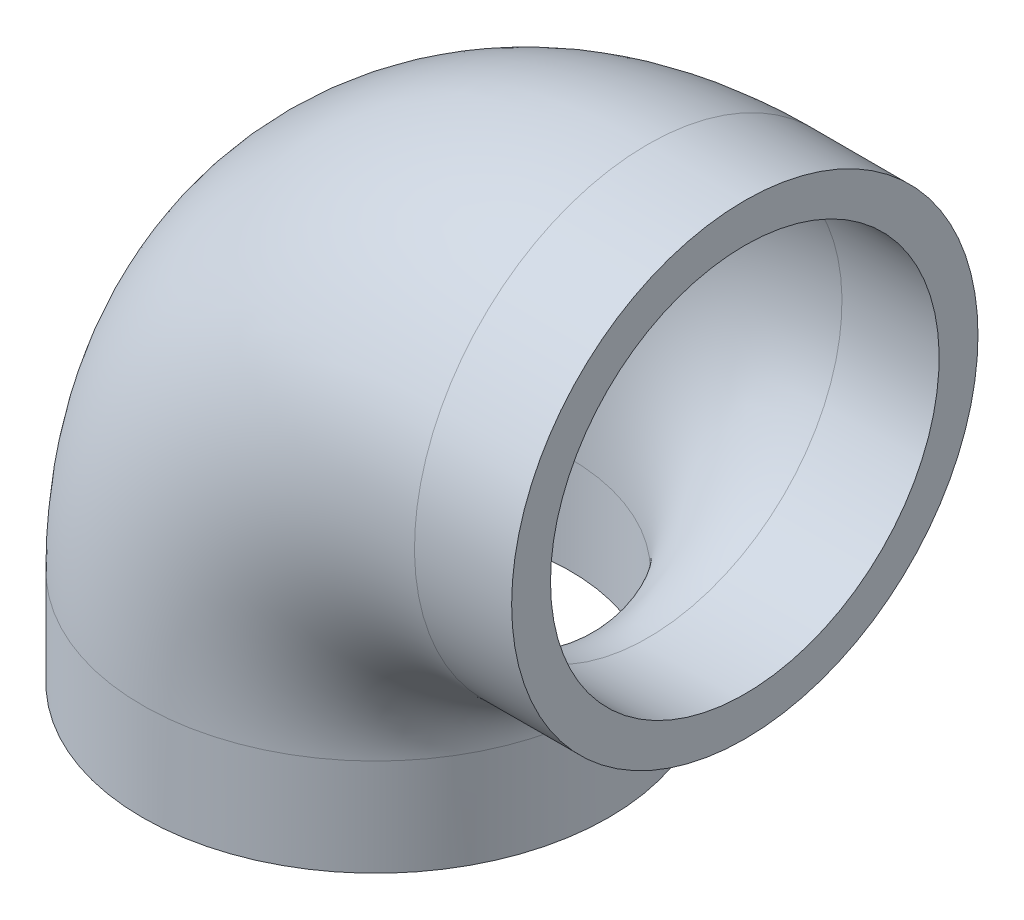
from build123d import *

# Parameters (mm, degrees)
SKETCH1_R   = 15.24
SKETCH1_R_2 = 12.7


with BuildPart() as part:
    # Sweep1: sweep along a path in Sketch2
    with BuildLine(Plane.XY) as sweep1_path:
        Line((0, 0), (0, 6.35))
        ThreePointArc((0, 6.35), (5.207641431, 18.922358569), (17.78, 24.13))
        Line((17.78, 24.13), (24.13, 24.13))
    # Sketch1 → Sweep1 (sweep)
    with BuildSketch(Plane(origin=(0, 0, 0), x_dir=(1, 0, 0), z_dir=(0, 1, 0))):
        Circle(SKETCH1_R)
        Circle(SKETCH1_R_2, mode=Mode.SUBTRACT)
    sweep(path=sweep1_path.line)


solid = part.part
